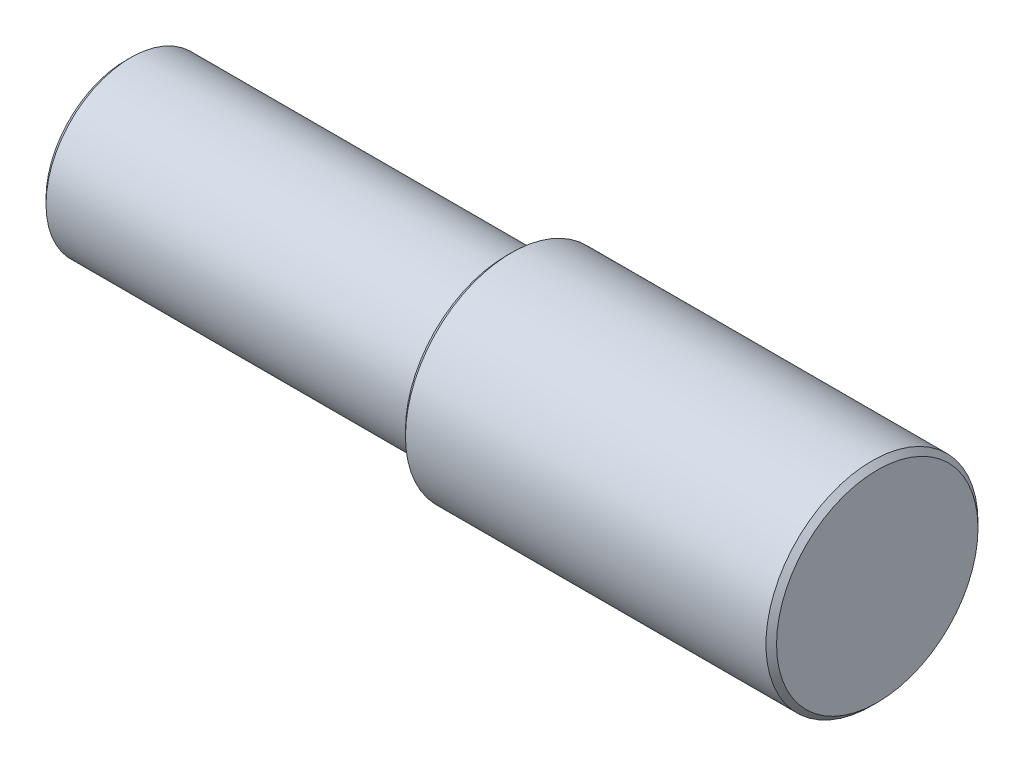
from build123d import *

# Parameters (mm, degrees)
SKETCH1_W                 = 35
SKETCH1_H                 = 10
SKETCH2_R                 = 8
BOSS_EXTRUDE1_DEPTH       = 35.9
M6X1_0_TAPPED_HOLE1_D     = 5
M6X1_0_TAPPED_HOLE1_DEPTH = 26
M6X1_0_TAPPED_HOLE1_TIP   = 1.502151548
CHAMFER1_SIZE             = 0.5
CUT_EXTRUDE2_DEPTH        = 10


with BuildPart() as part:
    # Sketch1 → Revolve1 (revolve)
    with BuildSketch(Plane.XY, mode=Mode.PRIVATE) as revolve1_sk:
        with Locations((-17.5, 5)):
            Rectangle(SKETCH1_W, SKETCH1_H)
    revolve(revolve1_sk.sketch.rotate(Axis((-35, 0, 0), (1, 0, 0)), 270), axis=Axis((-35, 0, 0), (1, 0, 0)))

    # Sketch2 → Boss-Extrude1 (add)
    with BuildSketch(Plane.ZY.offset(35)):
        Circle(SKETCH2_R)
    extrude(amount=BOSS_EXTRUDE1_DEPTH)

    # M6x1.0 Tapped Hole1
    with Locations(Plane.ZY.offset(70.9)):
        with Locations((0, 0)):
            Hole(M6X1_0_TAPPED_HOLE1_D / 2, depth=M6X1_0_TAPPED_HOLE1_DEPTH)
            with Locations((0, 0, -(M6X1_0_TAPPED_HOLE1_DEPTH + M6X1_0_TAPPED_HOLE1_TIP / 2))):  # 118° drill point
                Cone(0, M6X1_0_TAPPED_HOLE1_D / 2, M6X1_0_TAPPED_HOLE1_TIP, mode=Mode.SUBTRACT)

    # Chamfer1
    chamfer1_edges = [part.edges().sort_by_distance(p)[0] for p in [
        (-70.9, 0, -8),
        (-70.9, 0, 2.5),
        (0, 0, 10),
        (-35, 0, 10),
    ]]
    chamfer(chamfer1_edges, length=CHAMFER1_SIZE)

    # Sketch3 → Cut-Extrude2 (cut)
    with BuildSketch(Plane.XY.offset(-5)):
        with BuildLine():
            Line((-40.45, 2.5), (-65.45, 2.5))
            ThreePointArc((-65.45, 2.5), (-67.95, 0), (-65.45, -2.5))
            Line((-65.45, -2.5), (-40.45, -2.5))
            ThreePointArc((-40.45, -2.5), (-37.95, 0), (-40.45, 2.5))
        make_face()
    extrude(amount=-CUT_EXTRUDE2_DEPTH, mode=Mode.SUBTRACT)


solid = part.part
